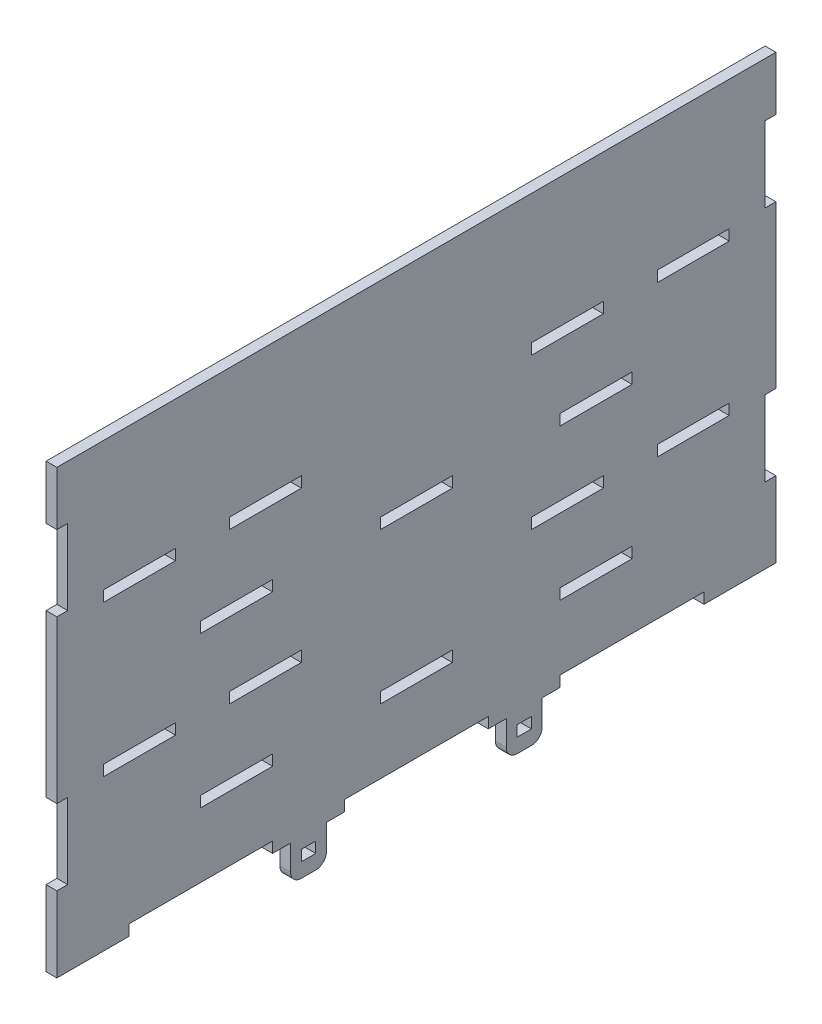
from build123d import *

# Parameters (mm, degrees)
SKETCH_1_W          = 200
SKETCH_1_H          = 120
EXTRUDE_1_DEPTH     = 3
SKETCH_2_W          = 20
SKETCH_2_H          = 3
EXTRUDE_3_DEPTH     = 3
SKETCH_5_W          = 20
SKETCH_5_H          = 3
SKETCH_5_W_2        = 3
SKETCH_5_H_2        = 21
CUT_EXTRUDE_2_DEPTH = 3
SKETCH_6_W          = 10
SKETCH_6_H          = 10
SKETCH_6_W_2        = 4
SKETCH_6_H_2        = 3
EXTRUDE_4_DEPTH     = 3
FILLET_1_R          = 3


with BuildPart() as part:
    # Sketch 1 → Extrude 1 (new body)
    with BuildSketch(Plane(origin=(0, 0, 0), x_dir=(0, 0, -1), z_dir=(1, 0, 0))):
        Rectangle(SKETCH_1_W, SKETCH_1_H)
    extrude(amount=EXTRUDE_1_DEPTH)

    # Sketch 2 → Extrude 3 (add)
    with BuildSketch(Plane(origin=(3, 0, 0), x_dir=(0, 0, -1), z_dir=(1, 0, 0))):
        with Locations((-90, -61.5)):
            Rectangle(SKETCH_2_W, SKETCH_2_H)
        with Locations((-30, -61.5)):
            Rectangle(SKETCH_2_W, SKETCH_2_H)
        with Locations((30, -61.5)):
            Rectangle(SKETCH_2_W, SKETCH_2_H)
        with Locations((90, -61.5)):
            Rectangle(SKETCH_2_W, SKETCH_2_H)
    extrude(amount=-EXTRUDE_3_DEPTH)

    # Sketch 5 → Cut-Extrude 2 (cut)
    with BuildSketch(Plane(origin=(3, 0, 0), x_dir=(0, 0, -1), z_dir=(1, 0, 0))):
        with Locations((-50, -40.5)):
            Rectangle(SKETCH_5_W, SKETCH_5_H)
        with Locations((0, -40.5)):
            Rectangle(SKETCH_5_W, SKETCH_5_H)
        with Locations((50, -40.5)):
            Rectangle(SKETCH_5_W, SKETCH_5_H)
        with Locations((0, 1.5)):
            Rectangle(SKETCH_5_W, SKETCH_5_H)
        with Locations((-50, 1.5)):
            Rectangle(SKETCH_5_W, SKETCH_5_H)
        with Locations((50, 1.5)):
            Rectangle(SKETCH_5_W, SKETCH_5_H)
        with Locations((-98.5, -31.5)):
            Rectangle(SKETCH_5_W_2, SKETCH_5_H_2)
        with Locations((-98.5, 34.5)):
            Rectangle(SKETCH_5_W_2, SKETCH_5_H_2)
        with Locations((-77, -19.5)):
            Rectangle(SKETCH_5_W, SKETCH_5_H)
        with Locations((-42, -19.5)):
            Rectangle(SKETCH_5_W, SKETCH_5_H)
        with Locations((98.5, 34.5)):
            Rectangle(SKETCH_5_W_2, SKETCH_5_H_2)
        with Locations((98.5, -31.5)):
            Rectangle(SKETCH_5_W_2, SKETCH_5_H_2)
        with Locations((42, -19.5)):
            Rectangle(SKETCH_5_W, SKETCH_5_H)
        with Locations((77, -19.5)):
            Rectangle(SKETCH_5_W, SKETCH_5_H)
        with Locations((42, 22.5)):
            Rectangle(SKETCH_5_W, SKETCH_5_H)
        with Locations((-77, 22.5)):
            Rectangle(SKETCH_5_W, SKETCH_5_H)
        with Locations((77, 22.5)):
            Rectangle(SKETCH_5_W, SKETCH_5_H)
        with Locations((-42, 22.5)):
            Rectangle(SKETCH_5_W, SKETCH_5_H)
    extrude(amount=-CUT_EXTRUDE_2_DEPTH, mode=Mode.SUBTRACT)

    # Sketch 6 → Extrude 4 (add)
    # profile 1 of 2: a face of its own
    with BuildSketch(Plane(origin=(3, 0, 0), x_dir=(0, 0, -1), z_dir=(1, 0, 0))):
        with Locations((-30, -68)):
            Rectangle(SKETCH_6_W, SKETCH_6_H)
        with Locations((-30, -67.5)):
            Rectangle(SKETCH_6_W_2, SKETCH_6_H_2, mode=Mode.SUBTRACT)
    # profile 2 of 2: a face of its own
    with BuildSketch(Plane(origin=(3, 0, 0), x_dir=(0, 0, -1), z_dir=(1, 0, 0))):
        with Locations((30, -68)):
            Rectangle(SKETCH_6_W, SKETCH_6_H)
        with Locations((30, -67.5)):
            Rectangle(SKETCH_6_W_2, SKETCH_6_H_2, mode=Mode.SUBTRACT)
    extrude(amount=-EXTRUDE_4_DEPTH)

    # Fillet 1
    fillet_1_edges = [part.edges().sort_by_distance(p)[0] for p in [
        (1.5, -73, 25),
        (1.5, -73, 35),
        (1.5, -73, -35),
        (1.5, -73, -25),
    ]]
    fillet(fillet_1_edges, radius=FILLET_1_R)


solid = part.part
